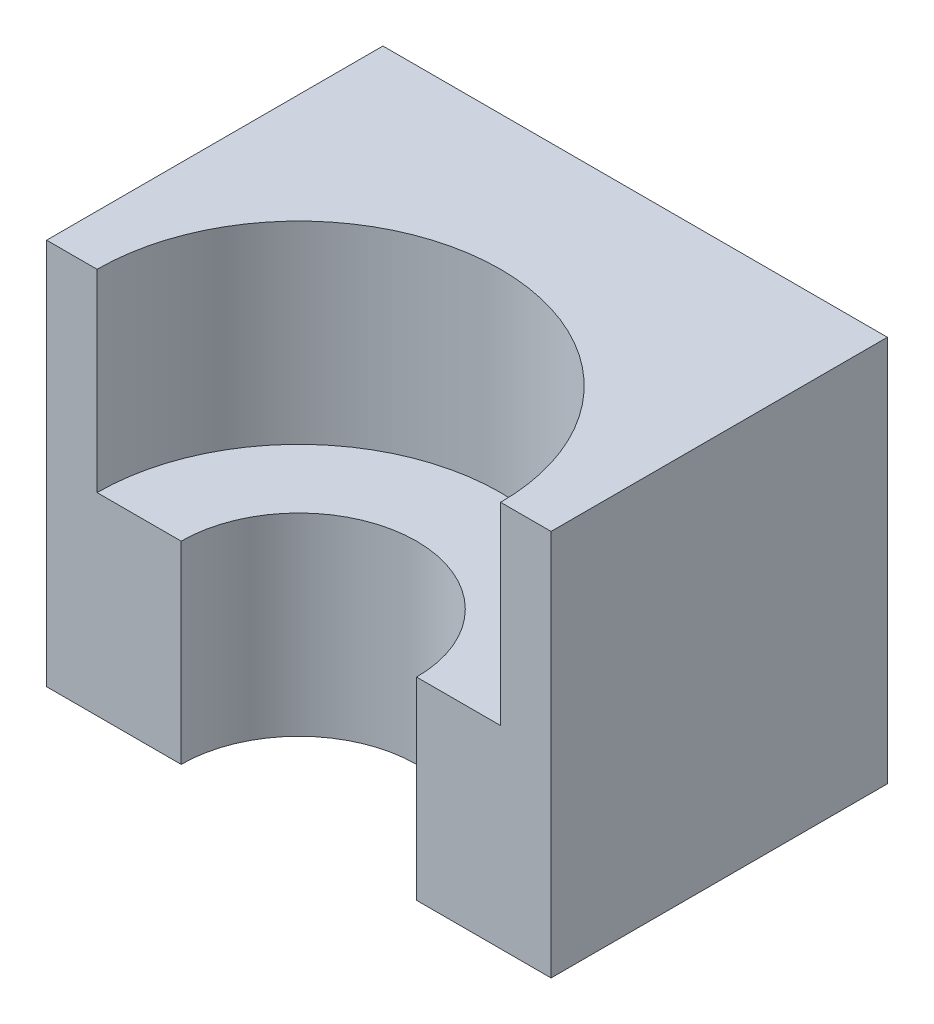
from build123d import *

# Parameters (mm, degrees)
SKETCH_1_W      = 30
SKETCH_1_H      = 23
EXTRUDE_1_DEPTH = 20


with BuildPart() as part:
    # Sketch 1 → Extrude 1 (new body)
    with BuildSketch(Plane.XY):
        Rectangle(SKETCH_1_W, SKETCH_1_H)
    extrude(amount=-EXTRUDE_1_DEPTH)

    # Sketch 2 → Cut-Revolve 1 (revolve, cut)
    with BuildSketch(Plane.XY):
        Polygon((12, 11.5), (12, 0), (7, 0), (7, -11.5), (0, -11.5), (0, 11.5), align=None)
    revolve(axis=Axis((0, 0, 0), (0, 1, 0)), mode=Mode.SUBTRACT)


solid = part.part
